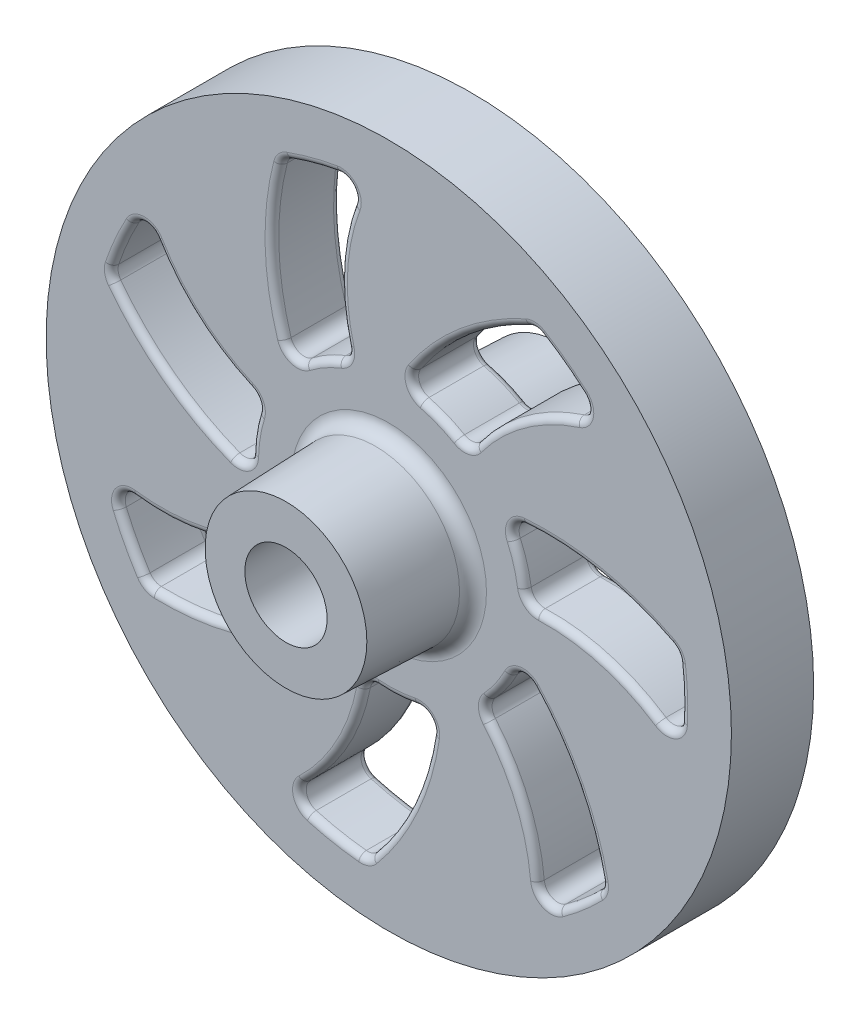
from build123d import *

# Parameters (mm, degrees)
SKETCH1_R                = 50
EXTRUDE1_DEPTH           = 5
SKETCH6_W                = 3
SKETCH6_H                = 2
FILLET4_R                = 1
SKETCH2_R                = 12.5
EXTRUDE2_DEPTH           = 20
EXTRUDE2_TAPER           = 2
EXTRUDE2_OTHER_WAY_DEPTH = 20
EXTRUDE2_OTHER_WAY_TAPER = 2
EXTRUDE6_DEPTH           = 74.484692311
EXTRUDE6_DEPTH_BACK      = 74.484692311
SKETCH4_R                = 6
SKETCH3_OUTSIDE_W        = 131.394
SKETCH3_OUTSIDE_H        = 131.394
SKETCH3_OUTSIDE_R        = 50
EXTRUDE3_DEPTH           = 74.484692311
FILLET1_R                = 2
FILLET3_R                = 1
CIRPATTERN1_COUNT        = 7
FILLET1_OF_CIRPATTERN1_R = 2
FILLET3_OF_CIRPATTERN1_R = 1
FILLET2_R                = 2


with BuildPart() as part:
    # Sketch1 → Extrude1 (new, symmetric)
    with BuildSketch(Plane.XY):
        Circle(SKETCH1_R)
    extrude(amount=EXTRUDE1_DEPTH, both=True)

    # Sketch6 → Revolve1 (revolve)
    with BuildSketch(Plane(origin=(0, 0, 0), x_dir=(1, 0, 0), z_dir=(0, 1, 0))):
        with Locations((48.5, 6)):
            Rectangle(SKETCH6_W, SKETCH6_H)
    revolve(axis=Axis((0, 0, 0), (0, 0, -1)))

    # Fillet4
    fillet4_edges = [part.edges().sort_by_distance(p)[0] for p in [
        (-47, 0, -5),
    ]]
    fillet(fillet4_edges, radius=FILLET4_R)

    # Sketch2 → Extrude2 (add)
    with BuildSketch(Plane.XY):
        Circle(SKETCH2_R)
    extrude(amount=EXTRUDE2_DEPTH, taper=EXTRUDE2_TAPER)

    # Sketch2 → Extrude2 other way (add)
    with BuildSketch(Plane.XY):
        Circle(SKETCH2_R)
    extrude(amount=-EXTRUDE2_OTHER_WAY_DEPTH, taper=EXTRUDE2_OTHER_WAY_TAPER)

    # Sketch4 → Extrude6 (cut, two sides: drawn at the far end of the back side and taken through both)
    with BuildSketch(Plane.XY.offset(-EXTRUDE6_DEPTH_BACK)):
        Circle(SKETCH4_R)
    extrude(amount=EXTRUDE6_DEPTH + EXTRUDE6_DEPTH_BACK, mode=Mode.SUBTRACT)

    # Sketch3 outside → Extrude3 (cut, symmetric)
    # profile 1 of 2: a face of its own
    with BuildSketch(Plane.XY):
        Rectangle(SKETCH3_OUTSIDE_W, SKETCH3_OUTSIDE_H)
        Circle(SKETCH3_OUTSIDE_R, mode=Mode.SUBTRACT)
    # profile 2 of 2: a face of its own
    with BuildSketch(Plane.XY):
        with BuildLine():
            ThreePointArc((11.607328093, 16.287109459), (7.084867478, 18.703065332), (2.096762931, 19.889785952))
            ThreePointArc((2.096762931, 19.889785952), (10.320788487, 29.979809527), (21.349139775, 36.894911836))
            ThreePointArc((21.349139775, 36.894911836), (26.371626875, 33.489663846), (30.859704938, 29.405763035))
            ThreePointArc((30.859704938, 29.405763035), (19.908077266, 24.791594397), (11.607328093, 16.287109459))
        make_face()
    extrude3 = extrude(amount=EXTRUDE3_DEPTH, both=True, mode=Mode.SUBTRACT)

    # Fillet1
    fillet1_edges = [part.edges().sort_by_distance(p)[0] for p in [
        (30.859704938, 29.405763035, 0),
        (11.607328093, 16.287109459, 0),
        (2.096762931, 19.889785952, 0),
        (21.349139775, 36.894911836, 0),
    ]]
    fillet(fillet1_edges, radius=FILLET1_R)

    # Fillet3
    fillet3_edges = [part.edges().sort_by_distance(p)[0] for p in [
        (11.07138241, 30.626420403, 5),
        (11.07138241, 30.626420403, -5),
        (25.340829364, 34.276269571, 5),
        (25.340829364, 34.276269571, -5),
        (19.264841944, 24.340848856, 5),
        (19.264841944, 24.340848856, -5),
        (7.53853164, 18.524862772, 5),
        (7.53853164, 18.524862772, -5),
        (21.33260967, 36.648616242, 5),
        (21.33260967, 36.648616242, -5),
        (28.870876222, 30.026787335, 5),
        (28.870876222, 30.026787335, -5),
        (11.468580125, 17.056918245, 5),
        (11.468580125, 17.056918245, -5),
        (3.488774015, 20.625115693, 5),
        (3.488774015, 20.625115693, -5),
    ]]
    fillet(fillet3_edges, radius=FILLET3_R)

    # CirPattern1: Extrude3 ×7 about axis
    cirpattern1_axis = Axis((0, 0, 0), (0, 0, 1))
    for i in range(1, CIRPATTERN1_COUNT):
        add(extrude3.rotate(cirpattern1_axis, i * 360 / CIRPATTERN1_COUNT), mode=Mode.SUBTRACT)

    # Fillet1 of CirPattern1
    fillet1_of_cirpattern1_edges = [part.edges().sort_by_distance(p)[0] for p in [
        (-3.749639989, 42.461282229, 0),
        (-5.49672424, 19.22982118, 0),
        (-14.243150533, 14.040393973, 0),
        (-15.534632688, 39.69503087, 0),
        (-35.535429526, 23.542589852, 0),
        (-18.461631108, 7.692085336, 0),
        (-19.857681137, -2.38170104, 0),
        (-40.720509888, 12.603982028, 0),
        (-40.562315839, -13.104152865, 0),
        (-17.524553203, -9.637947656, 0),
        (-10.518972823, -17.010326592, 0),
        (-35.243012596, -23.978122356, 0),
        (-15.044951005, -39.883201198, 0),
        (-3.3911293, -19.710409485, 0),
        (6.740736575, -18.829829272, 0),
        (-3.226807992, -42.504211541, 0),
        (21.801568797, -36.62938556, 0),
        (13.295884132, -14.940530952, 0),
        (18.924533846, -6.470086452, 0),
        (31.219248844, -29.023762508, 0),
        (42.231062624, -5.792895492, 0),
        (19.970825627, 1.079872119, 0),
        (16.857771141, 10.761763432, 0),
        (42.156574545, 6.31217167, 0),
    ]]
    fillet(fillet1_of_cirpattern1_edges, radius=FILLET1_OF_CIRPATTERN1_R)

    # Fillet3 of CirPattern1
    fillet3_of_cirpattern1_edges = [part.edges().sort_by_distance(p)[0] for p in [
        (-17.041805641, 27.751216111, 5),
        (-17.041805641, 27.751216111, -5),
        (-10.998517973, 41.183162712, 5),
        (-10.998517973, 41.183162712, -5),
        (-7.019009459, 30.238130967, 5),
        (-7.019009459, 30.238130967, -5),
        (-9.783123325, 17.443924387, 5),
        (-9.783123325, 17.443924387, -5),
        (-15.35237739, 39.528544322, 5),
        (-15.35237739, 39.528544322, -5),
        (-5.475190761, 41.293555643, 5),
        (-5.475190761, 41.293555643, -5),
        (-6.185092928, 19.601311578, 5),
        (-6.185092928, 19.601311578, -5),
        (-13.950149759, 15.587182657, 5),
        (-13.950149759, 15.587182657, -5),
        (-32.322166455, 3.978780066, 5),
        (-32.322166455, 3.978780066, -5),
        (-39.055756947, 17.078294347, 5),
        (-39.055756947, 17.078294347, -5),
        (-28.017403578, 13.365483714, 5),
        (-28.017403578, 13.365483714, -5),
        (-19.737886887, 3.227355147, 5),
        (-19.737886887, 3.227355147, -5),
        (-40.476711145, 12.642672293, 5),
        (-40.476711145, 12.642672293, -5),
        (-35.698327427, 21.465434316, 5),
        (-35.698327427, 21.465434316, -5),
        (-19.181264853, 7.385517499, 5),
        (-19.181264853, 7.385517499, -5),
        (-20.884326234, -1.18821684, 5),
        (-20.884326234, -1.18821684, -5),
        (-23.263276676, -22.789758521, 5),
        (-23.263276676, -22.789758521, -5),
        (-37.703214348, -19.886877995, 5),
        (-37.703214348, -19.886877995, -5),
        (-27.918121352, -13.571645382, 5),
        (-27.918121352, -13.571645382, -5),
        (-14.829619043, -13.419478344, 5),
        (-14.829619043, -13.419478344, -5),
        (-35.121255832, -23.763389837, 5),
        (-35.121255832, -23.763389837, -5),
        (-39.039895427, -14.526596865, 5),
        (-39.039895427, -14.526596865, -5),
        (-17.733553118, -10.391721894, 5),
        (-17.733553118, -10.391721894, -5),
        (-12.092179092, -17.068864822, 5),
        (-12.092179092, -17.068864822, -5),
        (3.313334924, -32.397144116, 5),
        (3.313334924, -32.397144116, -5),
        (-7.959382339, -41.876825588, 5),
        (-7.959382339, -41.876825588, -5),
        (-6.795924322, -30.289048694, 5),
        (-6.795924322, -30.289048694, -5),
        (1.245654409, -19.961170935, 5),
        (1.245654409, -19.961170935, -5),
        (-3.318778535, -42.275134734, 5),
        (-3.318778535, -42.275134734, -5),
        (-12.983625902, -39.579804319, 5),
        (-12.983625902, -39.579804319, -5),
        (-2.932114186, -20.343782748, 5),
        (-2.932114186, -20.343782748, -5),
        (5.805625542, -20.096309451, 5),
        (5.805625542, -20.096309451, -5),
        (27.394937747, -17.60881941, 5),
        (27.394937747, -17.60881941, -5),
        (27.778026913, -32.332669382, 5),
        (27.778026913, -32.332669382, -5),
        (19.443742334, -24.198180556, 5),
        (19.443742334, -24.198180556, -5),
        (16.382924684, -11.471694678, 5),
        (16.382924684, -11.471694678, -5),
        (30.98280669, -28.952840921, 5),
        (30.98280669, -28.952840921, -5),
        (22.849578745, -34.828611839, 5),
        (22.849578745, -34.828611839, -5),
        (14.077266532, -14.976560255, 5),
        (14.077266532, -14.976560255, -5),
        (19.331675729, -7.990823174, 5),
        (19.331675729, -7.990823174, -5),
        (30.847593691, 10.439305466, 5),
        (30.847593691, 10.439305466, -5),
        (42.598015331, 1.558646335, 5),
        (42.598015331, 1.558646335, -5),
        (31.041874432, 0.114411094, 5),
        (31.041874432, 0.114411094, -5),
        (19.183518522, 5.656201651, 5),
        (19.183518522, 5.656201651, -5),
        (41.953706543, 6.171532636, 5),
        (41.953706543, 6.171532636, -5),
        (41.476584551, -3.850764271, 5),
        (41.476584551, -3.850764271, -5),
        (20.486178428, 1.668317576, 5),
        (20.486178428, 1.668317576, -5),
        (18.300579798, 10.131915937, 5),
        (18.300579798, 10.131915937, -5),
    ]]
    fillet(fillet3_of_cirpattern1_edges, radius=FILLET3_OF_CIRPATTERN1_R)

    # Fillet2
    fillet2_edges = [part.edges().sort_by_distance(p)[0] for p in [
        (-12.325396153, 0, 5),
        (-12.325396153, 0, -5),
    ]]
    fillet(fillet2_edges, radius=FILLET2_R)


solid = part.part
